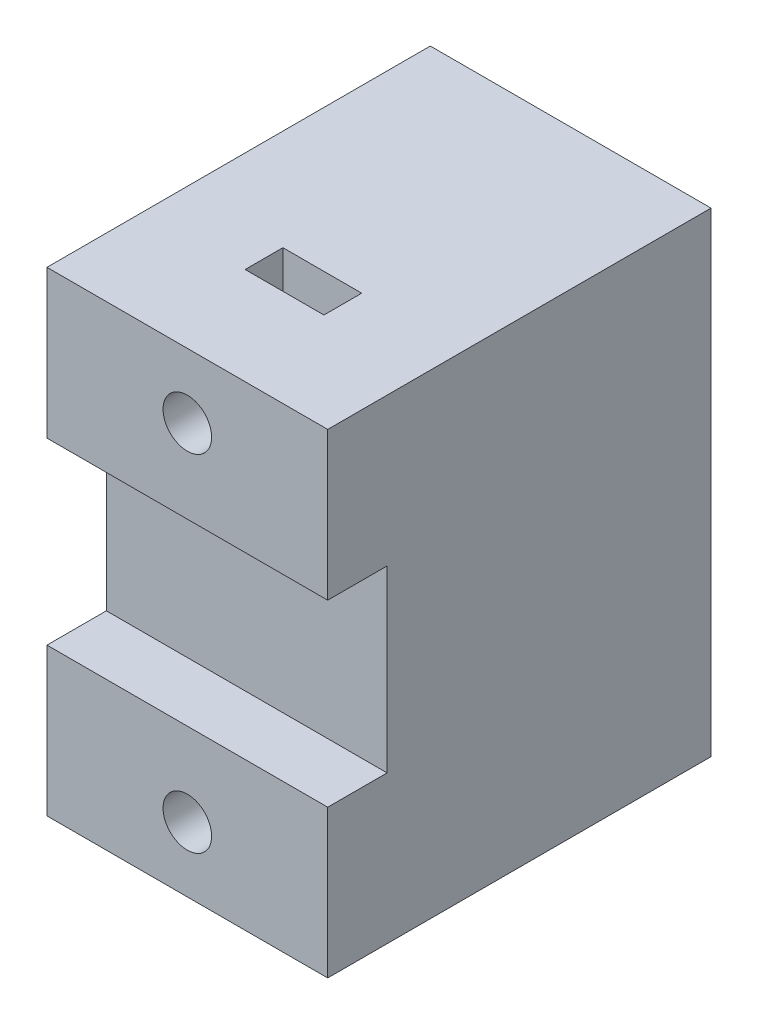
ISO-10303-21;
HEADER;
FILE_DESCRIPTION(('STEP AP214'),'2;1');
FILE_NAME('part.step','',(''),(''),'','','');
FILE_SCHEMA(('AUTOMOTIVE_DESIGN { 1 0 10303 214 1 1 1 1 }'));
ENDSEC;
DATA;
#1=APPLICATION_CONTEXT('core data for automotive mechanical design processes');
#2=APPLICATION_PROTOCOL_DEFINITION('international standard','automotive_design',2000,#1);
#3=PRODUCT_CONTEXT('',#1,'mechanical');
#4=PRODUCT('Part','Part','',(#3));
#5=PRODUCT_RELATED_PRODUCT_CATEGORY('part','',(#4));
#6=PRODUCT_DEFINITION_FORMATION('','',#4);
#7=PRODUCT_DEFINITION_CONTEXT('part definition',#1,'design');
#8=PRODUCT_DEFINITION('design','',#6,#7);
#9=PRODUCT_DEFINITION_SHAPE('','',#8);
#10=(LENGTH_UNIT() NAMED_UNIT(*) SI_UNIT(.MILLI.,.METRE.));
#11=(NAMED_UNIT(*) PLANE_ANGLE_UNIT() SI_UNIT($,.RADIAN.));
#12=(NAMED_UNIT(*) SI_UNIT($,.STERADIAN.) SOLID_ANGLE_UNIT());
#13=UNCERTAINTY_MEASURE_WITH_UNIT(LENGTH_MEASURE(1.E-05),#10,'distance_accuracy_value','');
#14=(GEOMETRIC_REPRESENTATION_CONTEXT(3) GLOBAL_UNCERTAINTY_ASSIGNED_CONTEXT((#13)) GLOBAL_UNIT_ASSIGNED_CONTEXT((#10,
#11,#12)) REPRESENTATION_CONTEXT('',''));
#15=CARTESIAN_POINT('',(0.,0.,0.));
#16=DIRECTION('',(0.,0.,1.));
#17=DIRECTION('',(1.,0.,0.));
#18=AXIS2_PLACEMENT_3D('',#15,#16,#17);
#19=CARTESIAN_POINT('',(0.,0.,23.));
#20=DIRECTION('',(0.,0.,1.));
#21=DIRECTION('',(1.,0.,0.));
#22=AXIS2_PLACEMENT_3D('',#19,#20,#21);
#23=PLANE('',#22);
#24=DIRECTION('',(0.,1.,0.));
#25=VECTOR('',#24,1.);
#26=CARTESIAN_POINT('',(-3.65,11.75,23.));
#27=LINE('',#26,#25);
#28=CARTESIAN_POINT('',(-3.65,11.75,23.));
#29=VERTEX_POINT('',#28);
#30=CARTESIAN_POINT('',(-3.64999999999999,22.,23.));
#31=VERTEX_POINT('',#30);
#32=EDGE_CURVE('E230',#29,#31,#27,.T.);
#33=ORIENTED_EDGE('',*,*,#32,.F.);
#34=DIRECTION('',(-1.,0.,0.));
#35=VECTOR('',#34,1.);
#36=CARTESIAN_POINT('',(3.65,11.75,23.));
#37=LINE('',#36,#35);
#38=CARTESIAN_POINT('',(3.65,11.75,23.));
#39=VERTEX_POINT('',#38);
#40=EDGE_CURVE('E257',#39,#29,#37,.T.);
#41=ORIENTED_EDGE('',*,*,#40,.F.);
#42=DIRECTION('',(0.,-1.,0.));
#43=VECTOR('',#42,1.);
#44=CARTESIAN_POINT('',(3.65,22.,23.));
#45=LINE('',#44,#43);
#46=CARTESIAN_POINT('',(3.65,22.,23.));
#47=VERTEX_POINT('',#46);
#48=EDGE_CURVE('E254',#47,#39,#45,.T.);
#49=ORIENTED_EDGE('',*,*,#48,.F.);
#50=DIRECTION('',(-1.,0.,0.));
#51=VECTOR('',#50,1.);
#52=CARTESIAN_POINT('',(13.,22.,23.));
#53=LINE('',#52,#51);
#54=EDGE_CURVE('E299',#47,#31,#53,.T.);
#55=ORIENTED_EDGE('',*,*,#54,.T.);
#56=EDGE_LOOP('',(#33,#41,#49,#55));
#57=FACE_BOUND('',#56,.T.);
#58=CARTESIAN_POINT('',(0.,16.,23.));
#59=DIRECTION('',(0.,0.,1.));
#60=DIRECTION('',(1.,0.,0.));
#61=AXIS2_PLACEMENT_3D('',#58,#59,#60);
#62=CIRCLE('',#61,2.25);
#63=CARTESIAN_POINT('',(2.25,16.,23.));
#64=VERTEX_POINT('',#63);
#65=EDGE_CURVE('E286',#64,#64,#62,.T.);
#66=ORIENTED_EDGE('',*,*,#65,.F.);
#67=EDGE_LOOP('',(#66));
#68=FACE_BOUND('',#67,.T.);
#69=ADVANCED_FACE('F43',(#57,#68),#23,.T.);
#70=DIRECTION('',(0.,-1.,0.));
#71=VECTOR('',#70,1.);
#72=CARTESIAN_POINT('',(3.65,-11.75,23.));
#73=LINE('',#72,#71);
#74=CARTESIAN_POINT('',(3.65,-11.75,23.));
#75=VERTEX_POINT('',#74);
#76=CARTESIAN_POINT('',(3.64999999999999,-22.,23.));
#77=VERTEX_POINT('',#76);
#78=EDGE_CURVE('E251',#75,#77,#73,.T.);
#79=ORIENTED_EDGE('',*,*,#78,.F.);
#80=DIRECTION('',(1.,0.,0.));
#81=VECTOR('',#80,1.);
#82=CARTESIAN_POINT('',(-3.65,-11.75,23.));
#83=LINE('',#82,#81);
#84=CARTESIAN_POINT('',(-3.65,-11.75,23.));
#85=VERTEX_POINT('',#84);
#86=EDGE_CURVE('E248',#85,#75,#83,.T.);
#87=ORIENTED_EDGE('',*,*,#86,.F.);
#88=DIRECTION('',(0.,1.,0.));
#89=VECTOR('',#88,1.);
#90=CARTESIAN_POINT('',(-3.65,-22.,23.));
#91=LINE('',#90,#89);
#92=CARTESIAN_POINT('',(-3.65,-22.,23.));
#93=VERTEX_POINT('',#92);
#94=EDGE_CURVE('E221',#93,#85,#91,.T.);
#95=ORIENTED_EDGE('',*,*,#94,.F.);
#96=DIRECTION('',(1.,0.,0.));
#97=VECTOR('',#96,1.);
#98=CARTESIAN_POINT('',(-13.,-22.,23.));
#99=LINE('',#98,#97);
#100=EDGE_CURVE('E297',#93,#77,#99,.T.);
#101=ORIENTED_EDGE('',*,*,#100,.T.);
#102=EDGE_LOOP('',(#79,#87,#95,#101));
#103=FACE_BOUND('',#102,.T.);
#104=CARTESIAN_POINT('',(0.,-16.,23.));
#105=DIRECTION('',(0.,0.,1.));
#106=DIRECTION('',(1.,0.,0.));
#107=AXIS2_PLACEMENT_3D('',#104,#105,#106);
#108=CIRCLE('',#107,2.25);
#109=CARTESIAN_POINT('',(2.25,-16.,23.));
#110=VERTEX_POINT('',#109);
#111=EDGE_CURVE('E292',#110,#110,#108,.T.);
#112=ORIENTED_EDGE('',*,*,#111,.F.);
#113=EDGE_LOOP('',(#112));
#114=FACE_BOUND('',#113,.T.);
#115=ADVANCED_FACE('F344',(#103,#114),#23,.T.);
#116=CARTESIAN_POINT('',(0.,0.,0.));
#117=DIRECTION('',(0.,0.,1.));
#118=DIRECTION('',(1.,0.,0.));
#119=AXIS2_PLACEMENT_3D('',#116,#117,#118);
#120=PLANE('',#119);
#121=DIRECTION('',(0.,-1.,0.));
#122=VECTOR('',#121,1.);
#123=CARTESIAN_POINT('',(-13.,22.,0.));
#124=LINE('',#123,#122);
#125=CARTESIAN_POINT('',(-13.,22.,0.));
#126=VERTEX_POINT('',#125);
#127=CARTESIAN_POINT('',(-13.,-22.,0.));
#128=VERTEX_POINT('',#127);
#129=EDGE_CURVE('E161',#126,#128,#124,.T.);
#130=ORIENTED_EDGE('',*,*,#129,.F.);
#131=DIRECTION('',(-1.,0.,0.));
#132=VECTOR('',#131,1.);
#133=CARTESIAN_POINT('',(13.,22.,0.));
#134=LINE('',#133,#132);
#135=CARTESIAN_POINT('',(13.,22.,0.));
#136=VERTEX_POINT('',#135);
#137=EDGE_CURVE('E300',#136,#126,#134,.T.);
#138=ORIENTED_EDGE('',*,*,#137,.F.);
#139=DIRECTION('',(0.,1.,0.));
#140=VECTOR('',#139,1.);
#141=CARTESIAN_POINT('',(13.,-22.,0.));
#142=LINE('',#141,#140);
#143=CARTESIAN_POINT('',(13.,-22.,0.));
#144=VERTEX_POINT('',#143);
#145=EDGE_CURVE('E306',#144,#136,#142,.T.);
#146=ORIENTED_EDGE('',*,*,#145,.F.);
#147=DIRECTION('',(1.,0.,0.));
#148=VECTOR('',#147,1.);
#149=CARTESIAN_POINT('',(-13.,-22.,0.));
#150=LINE('',#149,#148);
#151=EDGE_CURVE('E304',#128,#144,#150,.T.);
#152=ORIENTED_EDGE('',*,*,#151,.F.);
#153=EDGE_LOOP('',(#130,#138,#146,#152));
#154=FACE_BOUND('',#153,.T.);
#155=CARTESIAN_POINT('',(0.,-16.,0.));
#156=DIRECTION('',(0.,0.,1.));
#157=DIRECTION('',(1.,0.,0.));
#158=AXIS2_PLACEMENT_3D('',#155,#156,#157);
#159=CIRCLE('',#158,2.25);
#160=CARTESIAN_POINT('',(2.25,-16.,0.));
#161=VERTEX_POINT('',#160);
#162=EDGE_CURVE('E289',#161,#161,#159,.T.);
#163=ORIENTED_EDGE('',*,*,#162,.T.);
#164=EDGE_LOOP('',(#163));
#165=FACE_BOUND('',#164,.T.);
#166=CARTESIAN_POINT('',(0.,16.,0.));
#167=DIRECTION('',(0.,0.,1.));
#168=DIRECTION('',(1.,0.,0.));
#169=AXIS2_PLACEMENT_3D('',#166,#167,#168);
#170=CIRCLE('',#169,2.25);
#171=CARTESIAN_POINT('',(2.25,16.,0.));
#172=VERTEX_POINT('',#171);
#173=EDGE_CURVE('E285',#172,#172,#170,.T.);
#174=ORIENTED_EDGE('',*,*,#173,.T.);
#175=EDGE_LOOP('',(#174));
#176=FACE_BOUND('',#175,.T.);
#177=ADVANCED_FACE('F318',(#154,#165,#176),#120,.F.);
#178=CARTESIAN_POINT('',(-13.,22.,23.));
#179=DIRECTION('',(1.,0.,0.));
#180=DIRECTION('',(0.,0.,-1.));
#181=AXIS2_PLACEMENT_3D('',#178,#179,#180);
#182=PLANE('',#181);
#183=ORIENTED_EDGE('',*,*,#129,.T.);
#184=DIRECTION('',(0.,0.,-1.));
#185=VECTOR('',#184,1.);
#186=CARTESIAN_POINT('',(-13.,-22.,23.));
#187=LINE('',#186,#185);
#188=CARTESIAN_POINT('',(-13.,-22.,35.5));
#189=VERTEX_POINT('',#188);
#190=EDGE_CURVE('E11',#189,#128,#187,.T.);
#191=ORIENTED_EDGE('',*,*,#190,.F.);
#192=DIRECTION('',(0.,-1.,0.));
#193=VECTOR('',#192,1.);
#194=CARTESIAN_POINT('',(-13.,-8.3,35.5));
#195=LINE('',#194,#193);
#196=CARTESIAN_POINT('',(-13.,-8.3,35.5));
#197=VERTEX_POINT('',#196);
#198=EDGE_CURVE('E158',#197,#189,#195,.T.);
#199=ORIENTED_EDGE('',*,*,#198,.F.);
#200=DIRECTION('',(0.,0.,-1.));
#201=VECTOR('',#200,1.);
#202=CARTESIAN_POINT('',(-13.,-8.3,35.5));
#203=LINE('',#202,#201);
#204=CARTESIAN_POINT('',(-13.,-8.3,30.));
#205=VERTEX_POINT('',#204);
#206=EDGE_CURVE('E182',#197,#205,#203,.T.);
#207=ORIENTED_EDGE('',*,*,#206,.T.);
#208=DIRECTION('',(0.,-1.,0.));
#209=VECTOR('',#208,1.);
#210=CARTESIAN_POINT('',(-13.,22.,30.));
#211=LINE('',#210,#209);
#212=CARTESIAN_POINT('',(-13.,8.3,30.));
#213=VERTEX_POINT('',#212);
#214=EDGE_CURVE('E216',#213,#205,#211,.T.);
#215=ORIENTED_EDGE('',*,*,#214,.F.);
#216=DIRECTION('',(0.,0.,-1.));
#217=VECTOR('',#216,1.);
#218=CARTESIAN_POINT('',(-13.,8.3,35.5));
#219=LINE('',#218,#217);
#220=CARTESIAN_POINT('',(-13.,8.3,35.5));
#221=VERTEX_POINT('',#220);
#222=EDGE_CURVE('E189',#221,#213,#219,.T.);
#223=ORIENTED_EDGE('',*,*,#222,.F.);
#224=DIRECTION('',(0.,-1.,0.));
#225=VECTOR('',#224,1.);
#226=CARTESIAN_POINT('',(-13.,22.,35.5));
#227=LINE('',#226,#225);
#228=CARTESIAN_POINT('',(-13.,22.,35.5));
#229=VERTEX_POINT('',#228);
#230=EDGE_CURVE('E198',#229,#221,#227,.T.);
#231=ORIENTED_EDGE('',*,*,#230,.F.);
#232=DIRECTION('',(0.,0.,-1.));
#233=VECTOR('',#232,1.);
#234=CARTESIAN_POINT('',(-13.,22.,23.));
#235=LINE('',#234,#233);
#236=EDGE_CURVE('E302',#229,#126,#235,.T.);
#237=ORIENTED_EDGE('',*,*,#236,.T.);
#238=EDGE_LOOP('',(#183,#191,#199,#207,#215,#223,#231,#237));
#239=FACE_BOUND('',#238,.T.);
#240=ADVANCED_FACE('F45',(#239),#182,.F.);
#241=CARTESIAN_POINT('',(-13.,-22.,23.));
#242=DIRECTION('',(0.,1.,0.));
#243=DIRECTION('',(0.,0.,1.));
#244=AXIS2_PLACEMENT_3D('',#241,#242,#243);
#245=PLANE('',#244);
#246=DIRECTION('',(0.,0.,-1.));
#247=VECTOR('',#246,1.);
#248=CARTESIAN_POINT('',(-3.65,-22.,26.5));
#249=LINE('',#248,#247);
#250=CARTESIAN_POINT('',(-3.65,-22.,26.5));
#251=VERTEX_POINT('',#250);
#252=EDGE_CURVE('E282',#251,#93,#249,.T.);
#253=ORIENTED_EDGE('',*,*,#252,.F.);
#254=DIRECTION('',(1.,0.,0.));
#255=VECTOR('',#254,1.);
#256=CARTESIAN_POINT('',(-13.,-22.,26.5));
#257=LINE('',#256,#255);
#258=CARTESIAN_POINT('',(3.65,-22.,26.5));
#259=VERTEX_POINT('',#258);
#260=EDGE_CURVE('E215',#251,#259,#257,.T.);
#261=ORIENTED_EDGE('',*,*,#260,.T.);
#262=DIRECTION('',(0.,0.,-1.));
#263=VECTOR('',#262,1.);
#264=CARTESIAN_POINT('',(3.65,-22.,26.5));
#265=LINE('',#264,#263);
#266=EDGE_CURVE('E273',#259,#77,#265,.T.);
#267=ORIENTED_EDGE('',*,*,#266,.T.);
#268=ORIENTED_EDGE('',*,*,#100,.F.);
#269=EDGE_LOOP('',(#253,#261,#267,#268));
#270=FACE_BOUND('',#269,.T.);
#271=ORIENTED_EDGE('',*,*,#151,.T.);
#272=DIRECTION('',(0.,0.,-1.));
#273=VECTOR('',#272,1.);
#274=CARTESIAN_POINT('',(13.,-22.,23.));
#275=LINE('',#274,#273);
#276=CARTESIAN_POINT('',(13.,-22.,35.5));
#277=VERTEX_POINT('',#276);
#278=EDGE_CURVE('E51',#277,#144,#275,.T.);
#279=ORIENTED_EDGE('',*,*,#278,.F.);
#280=DIRECTION('',(1.,0.,0.));
#281=VECTOR('',#280,1.);
#282=CARTESIAN_POINT('',(-13.,-22.,35.5));
#283=LINE('',#282,#281);
#284=EDGE_CURVE('E164',#189,#277,#283,.T.);
#285=ORIENTED_EDGE('',*,*,#284,.F.);
#286=ORIENTED_EDGE('',*,*,#190,.T.);
#287=EDGE_LOOP('',(#271,#279,#285,#286));
#288=FACE_BOUND('',#287,.T.);
#289=ADVANCED_FACE('F165',(#270,#288),#245,.F.);
#290=CARTESIAN_POINT('',(13.,-22.,23.));
#291=DIRECTION('',(-1.,0.,0.));
#292=DIRECTION('',(0.,0.,1.));
#293=AXIS2_PLACEMENT_3D('',#290,#291,#292);
#294=PLANE('',#293);
#295=ORIENTED_EDGE('',*,*,#145,.T.);
#296=DIRECTION('',(0.,0.,-1.));
#297=VECTOR('',#296,1.);
#298=CARTESIAN_POINT('',(13.,22.,23.));
#299=LINE('',#298,#297);
#300=CARTESIAN_POINT('',(13.,22.,35.5));
#301=VERTEX_POINT('',#300);
#302=EDGE_CURVE('E310',#301,#136,#299,.T.);
#303=ORIENTED_EDGE('',*,*,#302,.F.);
#304=DIRECTION('',(0.,1.,0.));
#305=VECTOR('',#304,1.);
#306=CARTESIAN_POINT('',(13.,8.3,35.5));
#307=LINE('',#306,#305);
#308=CARTESIAN_POINT('',(13.,8.3,35.5));
#309=VERTEX_POINT('',#308);
#310=EDGE_CURVE('E201',#309,#301,#307,.T.);
#311=ORIENTED_EDGE('',*,*,#310,.F.);
#312=DIRECTION('',(0.,0.,-1.));
#313=VECTOR('',#312,1.);
#314=CARTESIAN_POINT('',(13.,8.3,35.5));
#315=LINE('',#314,#313);
#316=CARTESIAN_POINT('',(13.,8.3,30.));
#317=VERTEX_POINT('',#316);
#318=EDGE_CURVE('E192',#309,#317,#315,.T.);
#319=ORIENTED_EDGE('',*,*,#318,.T.);
#320=DIRECTION('',(0.,1.,0.));
#321=VECTOR('',#320,1.);
#322=CARTESIAN_POINT('',(13.,-22.,30.));
#323=LINE('',#322,#321);
#324=CARTESIAN_POINT('',(13.,-8.3,30.));
#325=VERTEX_POINT('',#324);
#326=EDGE_CURVE('E218',#325,#317,#323,.T.);
#327=ORIENTED_EDGE('',*,*,#326,.F.);
#328=DIRECTION('',(0.,0.,-1.));
#329=VECTOR('',#328,1.);
#330=CARTESIAN_POINT('',(13.,-8.3,35.5));
#331=LINE('',#330,#329);
#332=CARTESIAN_POINT('',(13.,-8.3,35.5));
#333=VERTEX_POINT('',#332);
#334=EDGE_CURVE('E185',#333,#325,#331,.T.);
#335=ORIENTED_EDGE('',*,*,#334,.F.);
#336=DIRECTION('',(0.,1.,0.));
#337=VECTOR('',#336,1.);
#338=CARTESIAN_POINT('',(13.,-22.,35.5));
#339=LINE('',#338,#337);
#340=EDGE_CURVE('E169',#277,#333,#339,.T.);
#341=ORIENTED_EDGE('',*,*,#340,.F.);
#342=ORIENTED_EDGE('',*,*,#278,.T.);
#343=EDGE_LOOP('',(#295,#303,#311,#319,#327,#335,#341,#342));
#344=FACE_BOUND('',#343,.T.);
#345=ADVANCED_FACE('F314',(#344),#294,.F.);
#346=CARTESIAN_POINT('',(13.,22.,23.));
#347=DIRECTION('',(0.,-1.,0.));
#348=DIRECTION('',(0.,0.,-1.));
#349=AXIS2_PLACEMENT_3D('',#346,#347,#348);
#350=PLANE('',#349);
#351=DIRECTION('',(0.,0.,-1.));
#352=VECTOR('',#351,1.);
#353=CARTESIAN_POINT('',(3.65,22.,26.5));
#354=LINE('',#353,#352);
#355=CARTESIAN_POINT('',(3.65,22.,26.5));
#356=VERTEX_POINT('',#355);
#357=EDGE_CURVE('E270',#356,#47,#354,.T.);
#358=ORIENTED_EDGE('',*,*,#357,.F.);
#359=DIRECTION('',(-1.,0.,0.));
#360=VECTOR('',#359,1.);
#361=CARTESIAN_POINT('',(13.,22.,26.5));
#362=LINE('',#361,#360);
#363=CARTESIAN_POINT('',(-3.64999999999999,22.,26.5));
#364=VERTEX_POINT('',#363);
#365=EDGE_CURVE('E219',#356,#364,#362,.T.);
#366=ORIENTED_EDGE('',*,*,#365,.T.);
#367=DIRECTION('',(0.,0.,-1.));
#368=VECTOR('',#367,1.);
#369=CARTESIAN_POINT('',(-3.65,22.,26.5));
#370=LINE('',#369,#368);
#371=EDGE_CURVE('E245',#364,#31,#370,.T.);
#372=ORIENTED_EDGE('',*,*,#371,.T.);
#373=ORIENTED_EDGE('',*,*,#54,.F.);
#374=EDGE_LOOP('',(#358,#366,#372,#373));
#375=FACE_BOUND('',#374,.T.);
#376=ORIENTED_EDGE('',*,*,#137,.T.);
#377=ORIENTED_EDGE('',*,*,#236,.F.);
#378=DIRECTION('',(-1.,0.,0.));
#379=VECTOR('',#378,1.);
#380=CARTESIAN_POINT('',(13.,22.,35.5));
#381=LINE('',#380,#379);
#382=EDGE_CURVE('E195',#301,#229,#381,.T.);
#383=ORIENTED_EDGE('',*,*,#382,.F.);
#384=ORIENTED_EDGE('',*,*,#302,.T.);
#385=EDGE_LOOP('',(#376,#377,#383,#384));
#386=FACE_BOUND('',#385,.T.);
#387=ADVANCED_FACE('F321',(#375,#386),#350,.F.);
#388=CARTESIAN_POINT('',(0.,-16.,23.));
#389=DIRECTION('',(0.,0.,-1.));
#390=DIRECTION('',(-1.,0.,0.));
#391=AXIS2_PLACEMENT_3D('',#388,#389,#390);
#392=CYLINDRICAL_SURFACE('',#391,2.25);
#393=ORIENTED_EDGE('',*,*,#111,.T.);
#394=EDGE_LOOP('',(#393));
#395=FACE_BOUND('',#394,.T.);
#396=ORIENTED_EDGE('',*,*,#162,.F.);
#397=EDGE_LOOP('',(#396));
#398=FACE_BOUND('',#397,.T.);
#399=ADVANCED_FACE('F355',(#395,#398),#392,.F.);
#400=CARTESIAN_POINT('',(0.,16.,23.));
#401=DIRECTION('',(0.,0.,-1.));
#402=DIRECTION('',(-1.,0.,0.));
#403=AXIS2_PLACEMENT_3D('',#400,#401,#402);
#404=CYLINDRICAL_SURFACE('',#403,2.25);
#405=ORIENTED_EDGE('',*,*,#65,.T.);
#406=EDGE_LOOP('',(#405));
#407=FACE_BOUND('',#406,.T.);
#408=ORIENTED_EDGE('',*,*,#173,.F.);
#409=EDGE_LOOP('',(#408));
#410=FACE_BOUND('',#409,.T.);
#411=ADVANCED_FACE('F390',(#407,#410),#404,.F.);
#412=CARTESIAN_POINT('',(-3.65,-22.,26.5));
#413=DIRECTION('',(-1.,0.,0.));
#414=DIRECTION('',(0.,0.,1.));
#415=AXIS2_PLACEMENT_3D('',#412,#413,#414);
#416=PLANE('',#415);
#417=ORIENTED_EDGE('',*,*,#94,.T.);
#418=DIRECTION('',(0.,0.,-1.));
#419=VECTOR('',#418,1.);
#420=CARTESIAN_POINT('',(-3.65,-11.75,26.5));
#421=LINE('',#420,#419);
#422=CARTESIAN_POINT('',(-3.65,-11.75,26.5));
#423=VERTEX_POINT('',#422);
#424=EDGE_CURVE('E279',#423,#85,#421,.T.);
#425=ORIENTED_EDGE('',*,*,#424,.F.);
#426=DIRECTION('',(0.,1.,0.));
#427=VECTOR('',#426,1.);
#428=CARTESIAN_POINT('',(-3.65,-22.,26.5));
#429=LINE('',#428,#427);
#430=EDGE_CURVE('E226',#251,#423,#429,.T.);
#431=ORIENTED_EDGE('',*,*,#430,.F.);
#432=ORIENTED_EDGE('',*,*,#252,.T.);
#433=EDGE_LOOP('',(#417,#425,#431,#432));
#434=FACE_BOUND('',#433,.T.);
#435=ADVANCED_FACE('F372',(#434),#416,.F.);
#436=CARTESIAN_POINT('',(-3.65,-11.75,26.5));
#437=DIRECTION('',(0.,1.,0.));
#438=DIRECTION('',(0.,0.,1.));
#439=AXIS2_PLACEMENT_3D('',#436,#437,#438);
#440=PLANE('',#439);
#441=ORIENTED_EDGE('',*,*,#86,.T.);
#442=DIRECTION('',(0.,0.,-1.));
#443=VECTOR('',#442,1.);
#444=CARTESIAN_POINT('',(3.65,-11.75,26.5));
#445=LINE('',#444,#443);
#446=CARTESIAN_POINT('',(3.65,-11.75,26.5));
#447=VERTEX_POINT('',#446);
#448=EDGE_CURVE('E276',#447,#75,#445,.T.);
#449=ORIENTED_EDGE('',*,*,#448,.F.);
#450=DIRECTION('',(1.,0.,0.));
#451=VECTOR('',#450,1.);
#452=CARTESIAN_POINT('',(-3.65,-11.75,26.5));
#453=LINE('',#452,#451);
#454=EDGE_CURVE('E229',#423,#447,#453,.T.);
#455=ORIENTED_EDGE('',*,*,#454,.F.);
#456=ORIENTED_EDGE('',*,*,#424,.T.);
#457=EDGE_LOOP('',(#441,#449,#455,#456));
#458=FACE_BOUND('',#457,.T.);
#459=ADVANCED_FACE('F381',(#458),#440,.F.);
#460=CARTESIAN_POINT('',(3.65,-11.75,26.5));
#461=DIRECTION('',(1.,0.,0.));
#462=DIRECTION('',(0.,0.,-1.));
#463=AXIS2_PLACEMENT_3D('',#460,#461,#462);
#464=PLANE('',#463);
#465=ORIENTED_EDGE('',*,*,#78,.T.);
#466=ORIENTED_EDGE('',*,*,#266,.F.);
#467=DIRECTION('',(0.,-1.,0.));
#468=VECTOR('',#467,1.);
#469=CARTESIAN_POINT('',(3.65,-11.75,26.5));
#470=LINE('',#469,#468);
#471=EDGE_CURVE('E233',#447,#259,#470,.T.);
#472=ORIENTED_EDGE('',*,*,#471,.F.);
#473=ORIENTED_EDGE('',*,*,#448,.T.);
#474=EDGE_LOOP('',(#465,#466,#472,#473));
#475=FACE_BOUND('',#474,.T.);
#476=ADVANCED_FACE('F378',(#475),#464,.F.);
#477=CARTESIAN_POINT('',(3.65,22.,26.5));
#478=DIRECTION('',(1.,0.,0.));
#479=DIRECTION('',(0.,0.,-1.));
#480=AXIS2_PLACEMENT_3D('',#477,#478,#479);
#481=PLANE('',#480);
#482=ORIENTED_EDGE('',*,*,#48,.T.);
#483=DIRECTION('',(0.,0.,-1.));
#484=VECTOR('',#483,1.);
#485=CARTESIAN_POINT('',(3.65,11.75,26.5));
#486=LINE('',#485,#484);
#487=CARTESIAN_POINT('',(3.65,11.75,26.5));
#488=VERTEX_POINT('',#487);
#489=EDGE_CURVE('E267',#488,#39,#486,.T.);
#490=ORIENTED_EDGE('',*,*,#489,.F.);
#491=DIRECTION('',(0.,-1.,0.));
#492=VECTOR('',#491,1.);
#493=CARTESIAN_POINT('',(3.65,22.,26.5));
#494=LINE('',#493,#492);
#495=EDGE_CURVE('E236',#356,#488,#494,.T.);
#496=ORIENTED_EDGE('',*,*,#495,.F.);
#497=ORIENTED_EDGE('',*,*,#357,.T.);
#498=EDGE_LOOP('',(#482,#490,#496,#497));
#499=FACE_BOUND('',#498,.T.);
#500=ADVANCED_FACE('F388',(#499),#481,.F.);
#501=CARTESIAN_POINT('',(3.65,11.75,26.5));
#502=DIRECTION('',(0.,-1.,0.));
#503=DIRECTION('',(0.,0.,-1.));
#504=AXIS2_PLACEMENT_3D('',#501,#502,#503);
#505=PLANE('',#504);
#506=ORIENTED_EDGE('',*,*,#40,.T.);
#507=DIRECTION('',(0.,0.,-1.));
#508=VECTOR('',#507,1.);
#509=CARTESIAN_POINT('',(-3.65,11.75,26.5));
#510=LINE('',#509,#508);
#511=CARTESIAN_POINT('',(-3.65,11.75,26.5));
#512=VERTEX_POINT('',#511);
#513=EDGE_CURVE('E264',#512,#29,#510,.T.);
#514=ORIENTED_EDGE('',*,*,#513,.F.);
#515=DIRECTION('',(-1.,0.,0.));
#516=VECTOR('',#515,1.);
#517=CARTESIAN_POINT('',(3.65,11.75,26.5));
#518=LINE('',#517,#516);
#519=EDGE_CURVE('E239',#488,#512,#518,.T.);
#520=ORIENTED_EDGE('',*,*,#519,.F.);
#521=ORIENTED_EDGE('',*,*,#489,.T.);
#522=EDGE_LOOP('',(#506,#514,#520,#521));
#523=FACE_BOUND('',#522,.T.);
#524=ADVANCED_FACE('F486',(#523),#505,.F.);
#525=CARTESIAN_POINT('',(-3.65,11.75,26.5));
#526=DIRECTION('',(-1.,0.,0.));
#527=DIRECTION('',(0.,0.,1.));
#528=AXIS2_PLACEMENT_3D('',#525,#526,#527);
#529=PLANE('',#528);
#530=ORIENTED_EDGE('',*,*,#32,.T.);
#531=ORIENTED_EDGE('',*,*,#371,.F.);
#532=DIRECTION('',(0.,1.,0.));
#533=VECTOR('',#532,1.);
#534=CARTESIAN_POINT('',(-3.65,11.75,26.5));
#535=LINE('',#534,#533);
#536=EDGE_CURVE('E242',#512,#364,#535,.T.);
#537=ORIENTED_EDGE('',*,*,#536,.F.);
#538=ORIENTED_EDGE('',*,*,#513,.T.);
#539=EDGE_LOOP('',(#530,#531,#537,#538));
#540=FACE_BOUND('',#539,.T.);
#541=ADVANCED_FACE('F495',(#540),#529,.F.);
#542=CARTESIAN_POINT('',(0.,0.,26.5));
#543=DIRECTION('',(0.,0.,1.));
#544=DIRECTION('',(1.,0.,0.));
#545=AXIS2_PLACEMENT_3D('',#542,#543,#544);
#546=PLANE('',#545);
#547=CARTESIAN_POINT('',(0.,-16.,26.5));
#548=DIRECTION('',(0.,0.,1.));
#549=DIRECTION('',(1.,0.,0.));
#550=AXIS2_PLACEMENT_3D('',#547,#548,#549);
#551=CIRCLE('',#550,2.25);
#552=CARTESIAN_POINT('',(2.25,-16.,26.5));
#553=VERTEX_POINT('',#552);
#554=EDGE_CURVE('E212',#553,#553,#551,.T.);
#555=ORIENTED_EDGE('',*,*,#554,.T.);
#556=EDGE_LOOP('',(#555));
#557=FACE_BOUND('',#556,.T.);
#558=ORIENTED_EDGE('',*,*,#260,.F.);
#559=ORIENTED_EDGE('',*,*,#430,.T.);
#560=ORIENTED_EDGE('',*,*,#454,.T.);
#561=ORIENTED_EDGE('',*,*,#471,.T.);
#562=EDGE_LOOP('',(#558,#559,#560,#561));
#563=FACE_BOUND('',#562,.T.);
#564=ADVANCED_FACE('F375',(#557,#563),#546,.F.);
#565=CARTESIAN_POINT('',(0.,16.,26.5));
#566=DIRECTION('',(0.,0.,1.));
#567=DIRECTION('',(1.,0.,0.));
#568=AXIS2_PLACEMENT_3D('',#565,#566,#567);
#569=CIRCLE('',#568,2.25);
#570=CARTESIAN_POINT('',(2.25,16.,26.5));
#571=VERTEX_POINT('',#570);
#572=EDGE_CURVE('E188',#571,#571,#569,.T.);
#573=ORIENTED_EDGE('',*,*,#572,.T.);
#574=EDGE_LOOP('',(#573));
#575=FACE_BOUND('',#574,.T.);
#576=ORIENTED_EDGE('',*,*,#365,.F.);
#577=ORIENTED_EDGE('',*,*,#495,.T.);
#578=ORIENTED_EDGE('',*,*,#519,.T.);
#579=ORIENTED_EDGE('',*,*,#536,.T.);
#580=EDGE_LOOP('',(#576,#577,#578,#579));
#581=FACE_BOUND('',#580,.T.);
#582=ADVANCED_FACE('F585',(#575,#581),#546,.F.);
#583=CARTESIAN_POINT('',(0.,0.,30.));
#584=DIRECTION('',(0.,0.,1.));
#585=DIRECTION('',(1.,0.,0.));
#586=AXIS2_PLACEMENT_3D('',#583,#584,#585);
#587=PLANE('',#586);
#588=DIRECTION('',(-1.,0.,0.));
#589=VECTOR('',#588,1.);
#590=CARTESIAN_POINT('',(13.,-8.3,30.));
#591=LINE('',#590,#589);
#592=EDGE_CURVE('E58',#325,#205,#591,.T.);
#593=ORIENTED_EDGE('',*,*,#592,.F.);
#594=ORIENTED_EDGE('',*,*,#326,.T.);
#595=DIRECTION('',(1.,0.,0.));
#596=VECTOR('',#595,1.);
#597=CARTESIAN_POINT('',(-13.,8.3,30.));
#598=LINE('',#597,#596);
#599=EDGE_CURVE('E63',#213,#317,#598,.T.);
#600=ORIENTED_EDGE('',*,*,#599,.F.);
#601=ORIENTED_EDGE('',*,*,#214,.T.);
#602=EDGE_LOOP('',(#593,#594,#600,#601));
#603=FACE_BOUND('',#602,.T.);
#604=ADVANCED_FACE('F544',(#603),#587,.T.);
#605=CARTESIAN_POINT('',(0.,-16.,30.));
#606=DIRECTION('',(0.,0.,-1.));
#607=DIRECTION('',(-1.,0.,0.));
#608=AXIS2_PLACEMENT_3D('',#605,#606,#607);
#609=CYLINDRICAL_SURFACE('',#608,2.25);
#610=ORIENTED_EDGE('',*,*,#554,.F.);
#611=EDGE_LOOP('',(#610));
#612=FACE_BOUND('',#611,.T.);
#613=CARTESIAN_POINT('',(0.,-16.,35.5));
#614=DIRECTION('',(0.,0.,1.));
#615=DIRECTION('',(1.,0.,0.));
#616=AXIS2_PLACEMENT_3D('',#613,#614,#615);
#617=CIRCLE('',#616,2.25);
#618=CARTESIAN_POINT('',(2.25,-16.,35.5));
#619=VERTEX_POINT('',#618);
#620=EDGE_CURVE('E177',#619,#619,#617,.T.);
#621=ORIENTED_EDGE('',*,*,#620,.T.);
#622=EDGE_LOOP('',(#621));
#623=FACE_BOUND('',#622,.T.);
#624=ADVANCED_FACE('F538',(#612,#623),#609,.F.);
#625=CARTESIAN_POINT('',(0.,16.,30.));
#626=DIRECTION('',(0.,0.,-1.));
#627=DIRECTION('',(-1.,0.,0.));
#628=AXIS2_PLACEMENT_3D('',#625,#626,#627);
#629=CYLINDRICAL_SURFACE('',#628,2.25);
#630=ORIENTED_EDGE('',*,*,#572,.F.);
#631=EDGE_LOOP('',(#630));
#632=FACE_BOUND('',#631,.T.);
#633=CARTESIAN_POINT('',(0.,16.,35.5));
#634=DIRECTION('',(0.,0.,1.));
#635=DIRECTION('',(1.,0.,0.));
#636=AXIS2_PLACEMENT_3D('',#633,#634,#635);
#637=CIRCLE('',#636,2.25);
#638=CARTESIAN_POINT('',(2.25,16.,35.5));
#639=VERTEX_POINT('',#638);
#640=EDGE_CURVE('E197',#639,#639,#637,.T.);
#641=ORIENTED_EDGE('',*,*,#640,.T.);
#642=EDGE_LOOP('',(#641));
#643=FACE_BOUND('',#642,.T.);
#644=ADVANCED_FACE('F340',(#632,#643),#629,.F.);
#645=CARTESIAN_POINT('',(0.,0.,35.5));
#646=DIRECTION('',(0.,0.,1.));
#647=DIRECTION('',(1.,0.,0.));
#648=AXIS2_PLACEMENT_3D('',#645,#646,#647);
#649=PLANE('',#648);
#650=ORIENTED_EDGE('',*,*,#230,.T.);
#651=DIRECTION('',(1.,0.,0.));
#652=VECTOR('',#651,1.);
#653=CARTESIAN_POINT('',(-13.,8.3,35.5));
#654=LINE('',#653,#652);
#655=EDGE_CURVE('E204',#221,#309,#654,.T.);
#656=ORIENTED_EDGE('',*,*,#655,.T.);
#657=ORIENTED_EDGE('',*,*,#310,.T.);
#658=ORIENTED_EDGE('',*,*,#382,.T.);
#659=EDGE_LOOP('',(#650,#656,#657,#658));
#660=FACE_BOUND('',#659,.T.);
#661=ORIENTED_EDGE('',*,*,#640,.F.);
#662=EDGE_LOOP('',(#661));
#663=FACE_BOUND('',#662,.T.);
#664=ADVANCED_FACE('F326',(#660,#663),#649,.T.);
#665=CARTESIAN_POINT('',(-13.,8.3,35.5));
#666=DIRECTION('',(0.,1.,0.));
#667=DIRECTION('',(0.,0.,1.));
#668=AXIS2_PLACEMENT_3D('',#665,#666,#667);
#669=PLANE('',#668);
#670=ORIENTED_EDGE('',*,*,#599,.T.);
#671=ORIENTED_EDGE('',*,*,#318,.F.);
#672=ORIENTED_EDGE('',*,*,#655,.F.);
#673=ORIENTED_EDGE('',*,*,#222,.T.);
#674=EDGE_LOOP('',(#670,#671,#672,#673));
#675=FACE_BOUND('',#674,.T.);
#676=ADVANCED_FACE('F331',(#675),#669,.F.);
#677=CARTESIAN_POINT('',(0.,0.,35.5));
#678=DIRECTION('',(0.,0.,1.));
#679=DIRECTION('',(1.,0.,0.));
#680=AXIS2_PLACEMENT_3D('',#677,#678,#679);
#681=PLANE('',#680);
#682=ORIENTED_EDGE('',*,*,#198,.T.);
#683=ORIENTED_EDGE('',*,*,#284,.T.);
#684=ORIENTED_EDGE('',*,*,#340,.T.);
#685=DIRECTION('',(-1.,0.,0.));
#686=VECTOR('',#685,1.);
#687=CARTESIAN_POINT('',(13.,-8.3,35.5));
#688=LINE('',#687,#686);
#689=EDGE_CURVE('E174',#333,#197,#688,.T.);
#690=ORIENTED_EDGE('',*,*,#689,.T.);
#691=EDGE_LOOP('',(#682,#683,#684,#690));
#692=FACE_BOUND('',#691,.T.);
#693=ORIENTED_EDGE('',*,*,#620,.F.);
#694=EDGE_LOOP('',(#693));
#695=FACE_BOUND('',#694,.T.);
#696=ADVANCED_FACE('F171',(#692,#695),#681,.T.);
#697=CARTESIAN_POINT('',(13.,-8.3,35.5));
#698=DIRECTION('',(0.,-1.,0.));
#699=DIRECTION('',(0.,0.,-1.));
#700=AXIS2_PLACEMENT_3D('',#697,#698,#699);
#701=PLANE('',#700);
#702=ORIENTED_EDGE('',*,*,#592,.T.);
#703=ORIENTED_EDGE('',*,*,#206,.F.);
#704=ORIENTED_EDGE('',*,*,#689,.F.);
#705=ORIENTED_EDGE('',*,*,#334,.T.);
#706=EDGE_LOOP('',(#702,#703,#704,#705));
#707=FACE_BOUND('',#706,.T.);
#708=ADVANCED_FACE('F338',(#707),#701,.F.);
#709=CLOSED_SHELL('',(#69,#115,#177,#240,#289,#345,#387,#399,#411,#435,#459,#476,#500,#524,#541,
#564,#582,#604,#624,#644,#664,#676,#696,#708));
#710=MANIFOLD_SOLID_BREP('B2',#709);
#711=ADVANCED_BREP_SHAPE_REPRESENTATION('',(#18,#710),#14);
#712=SHAPE_DEFINITION_REPRESENTATION(#9,#711);
ENDSEC;
END-ISO-10303-21;
